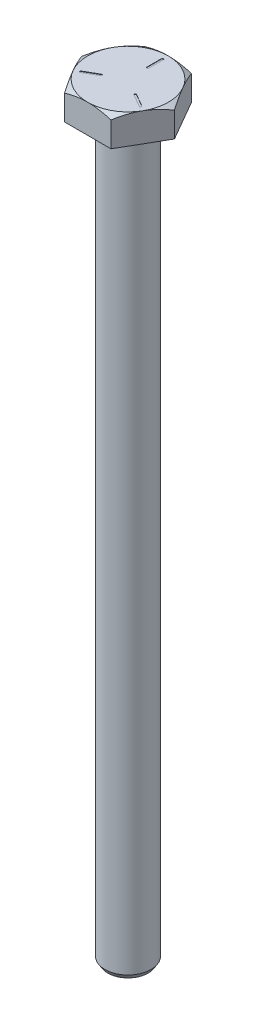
ISO-10303-21;
HEADER;
FILE_DESCRIPTION(('STEP AP214'),'2;1');
FILE_NAME('part.step','',(''),(''),'','','');
FILE_SCHEMA(('AUTOMOTIVE_DESIGN { 1 0 10303 214 1 1 1 1 }'));
ENDSEC;
DATA;
#1=APPLICATION_CONTEXT('core data for automotive mechanical design processes');
#2=APPLICATION_PROTOCOL_DEFINITION('international standard','automotive_design',2000,#1);
#3=PRODUCT_CONTEXT('',#1,'mechanical');
#4=PRODUCT('Part','Part','',(#3));
#5=PRODUCT_RELATED_PRODUCT_CATEGORY('part','',(#4));
#6=PRODUCT_DEFINITION_FORMATION('','',#4);
#7=PRODUCT_DEFINITION_CONTEXT('part definition',#1,'design');
#8=PRODUCT_DEFINITION('design','',#6,#7);
#9=PRODUCT_DEFINITION_SHAPE('','',#8);
#10=(LENGTH_UNIT() NAMED_UNIT(*) SI_UNIT(.MILLI.,.METRE.));
#11=(NAMED_UNIT(*) PLANE_ANGLE_UNIT() SI_UNIT($,.RADIAN.));
#12=(NAMED_UNIT(*) SI_UNIT($,.STERADIAN.) SOLID_ANGLE_UNIT());
#13=UNCERTAINTY_MEASURE_WITH_UNIT(LENGTH_MEASURE(1.E-05),#10,'distance_accuracy_value','');
#14=(GEOMETRIC_REPRESENTATION_CONTEXT(3) GLOBAL_UNCERTAINTY_ASSIGNED_CONTEXT((#13)) GLOBAL_UNIT_ASSIGNED_CONTEXT((#10,
#11,#12)) REPRESENTATION_CONTEXT('',''));
#15=CARTESIAN_POINT('',(0.,0.,0.));
#16=DIRECTION('',(0.,0.,1.));
#17=DIRECTION('',(1.,0.,0.));
#18=AXIS2_PLACEMENT_3D('',#15,#16,#17);
#19=CARTESIAN_POINT('',(0.,3.9624,0.));
#20=DIRECTION('',(0.,1.,0.));
#21=DIRECTION('',(0.,0.,1.));
#22=AXIS2_PLACEMENT_3D('',#19,#20,#21);
#23=PLANE('',#22);
#24=CARTESIAN_POINT('',(0.,3.9624,0.));
#25=DIRECTION('',(0.,1.,0.));
#26=DIRECTION('',(0.,0.,1.));
#27=AXIS2_PLACEMENT_3D('',#24,#25,#26);
#28=CIRCLE('',#27,5.55625);
#29=CARTESIAN_POINT('',(0.,3.9624,5.55625));
#30=VERTEX_POINT('',#29);
#31=CARTESIAN_POINT('',(-4.81185364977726,3.9624,2.77812500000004));
#32=VERTEX_POINT('',#31);
#33=EDGE_CURVE('E11',#30,#32,#28,.F.);
#34=ORIENTED_EDGE('',*,*,#33,.F.);
#35=CARTESIAN_POINT('',(0.,3.9624,0.));
#36=DIRECTION('',(0.,-1.,0.));
#37=DIRECTION('',(1.,0.,0.));
#38=AXIS2_PLACEMENT_3D('',#35,#36,#37);
#39=CIRCLE('',#38,5.55625);
#40=CARTESIAN_POINT('',(4.8118536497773,3.9624,2.77812499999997));
#41=VERTEX_POINT('',#40);
#42=EDGE_CURVE('E199',#41,#30,#39,.T.);
#43=ORIENTED_EDGE('',*,*,#42,.F.);
#44=CARTESIAN_POINT('',(4.81185364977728,3.9624,-2.778125));
#45=VERTEX_POINT('',#44);
#46=EDGE_CURVE('E42',#45,#41,#28,.F.);
#47=ORIENTED_EDGE('',*,*,#46,.F.);
#48=CARTESIAN_POINT('',(0.,3.9624,-5.55625));
#49=VERTEX_POINT('',#48);
#50=EDGE_CURVE('E521',#49,#45,#28,.F.);
#51=ORIENTED_EDGE('',*,*,#50,.F.);
#52=CARTESIAN_POINT('',(-4.8118536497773,3.9624,-2.77812499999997));
#53=VERTEX_POINT('',#52);
#54=EDGE_CURVE('E523',#53,#49,#28,.F.);
#55=ORIENTED_EDGE('',*,*,#54,.F.);
#56=EDGE_CURVE('E41',#32,#53,#28,.F.);
#57=ORIENTED_EDGE('',*,*,#56,.F.);
#58=EDGE_LOOP('',(#34,#43,#47,#51,#55,#57));
#59=FACE_BOUND('',#58,.T.);
#60=DIRECTION('',(0.866025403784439,0.,0.5));
#61=VECTOR('',#60,1.);
#62=CARTESIAN_POINT('',(4.18794598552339,3.9624,2.27126477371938));
#63=LINE('',#62,#61);
#64=CARTESIAN_POINT('',(2.42818236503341,3.9624,1.25526477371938));
#65=VERTEX_POINT('',#64);
#66=CARTESIAN_POINT('',(4.18794598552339,3.9624,2.27126477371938));
#67=VERTEX_POINT('',#66);
#68=EDGE_CURVE('E241',#65,#67,#63,.T.);
#69=ORIENTED_EDGE('',*,*,#68,.T.);
#70=CARTESIAN_POINT('',(4.12444598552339,3.9624,2.38125));
#71=DIRECTION('',(0.,-1.,0.));
#72=DIRECTION('',(0.,0.,-1.));
#73=AXIS2_PLACEMENT_3D('',#70,#71,#72);
#74=CIRCLE('',#73,0.127);
#75=CARTESIAN_POINT('',(4.06094598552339,3.9624,2.49123522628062));
#76=VERTEX_POINT('',#75);
#77=EDGE_CURVE('E248',#67,#76,#74,.T.);
#78=ORIENTED_EDGE('',*,*,#77,.T.);
#79=DIRECTION('',(-0.866025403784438,0.,-0.5));
#80=VECTOR('',#79,1.);
#81=CARTESIAN_POINT('',(4.06094598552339,3.9624,2.49123522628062));
#82=LINE('',#81,#80);
#83=CARTESIAN_POINT('',(2.30118236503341,3.9624,1.47523522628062));
#84=VERTEX_POINT('',#83);
#85=EDGE_CURVE('E251',#76,#84,#82,.T.);
#86=ORIENTED_EDGE('',*,*,#85,.T.);
#87=CARTESIAN_POINT('',(2.36468236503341,3.9624,1.36525));
#88=DIRECTION('',(0.,-1.,0.));
#89=DIRECTION('',(0.,0.,-1.));
#90=AXIS2_PLACEMENT_3D('',#87,#88,#89);
#91=CIRCLE('',#90,0.127);
#92=EDGE_CURVE('E255',#84,#65,#91,.T.);
#93=ORIENTED_EDGE('',*,*,#92,.T.);
#94=EDGE_LOOP('',(#69,#78,#86,#93));
#95=FACE_BOUND('',#94,.T.);
#96=DIRECTION('',(-0.866025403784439,0.,0.5));
#97=VECTOR('',#96,1.);
#98=CARTESIAN_POINT('',(-4.06094598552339,3.9624,2.49123522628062));
#99=LINE('',#98,#97);
#100=CARTESIAN_POINT('',(-2.30118236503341,3.9624,1.47523522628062));
#101=VERTEX_POINT('',#100);
#102=CARTESIAN_POINT('',(-4.06094598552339,3.9624,2.49123522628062));
#103=VERTEX_POINT('',#102);
#104=EDGE_CURVE('E213',#101,#103,#99,.T.);
#105=ORIENTED_EDGE('',*,*,#104,.T.);
#106=CARTESIAN_POINT('',(-4.12444598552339,3.9624,2.38125));
#107=DIRECTION('',(0.,-1.,0.));
#108=DIRECTION('',(0.,0.,-1.));
#109=AXIS2_PLACEMENT_3D('',#106,#107,#108);
#110=CIRCLE('',#109,0.127);
#111=CARTESIAN_POINT('',(-4.18794598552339,3.9624,2.27126477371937));
#112=VERTEX_POINT('',#111);
#113=EDGE_CURVE('E57',#103,#112,#110,.T.);
#114=ORIENTED_EDGE('',*,*,#113,.T.);
#115=DIRECTION('',(0.866025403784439,0.,-0.5));
#116=VECTOR('',#115,1.);
#117=CARTESIAN_POINT('',(-4.18794598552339,3.9624,2.27126477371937));
#118=LINE('',#117,#116);
#119=CARTESIAN_POINT('',(-2.42818236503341,3.9624,1.25526477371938));
#120=VERTEX_POINT('',#119);
#121=EDGE_CURVE('E221',#112,#120,#118,.T.);
#122=ORIENTED_EDGE('',*,*,#121,.T.);
#123=CARTESIAN_POINT('',(-2.36468236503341,3.9624,1.36525));
#124=DIRECTION('',(0.,-1.,0.));
#125=DIRECTION('',(0.,0.,-1.));
#126=AXIS2_PLACEMENT_3D('',#123,#124,#125);
#127=CIRCLE('',#126,0.127);
#128=EDGE_CURVE('E225',#120,#101,#127,.T.);
#129=ORIENTED_EDGE('',*,*,#128,.T.);
#130=EDGE_LOOP('',(#105,#114,#122,#129));
#131=FACE_BOUND('',#130,.T.);
#132=DIRECTION('',(0.,0.,-1.));
#133=VECTOR('',#132,1.);
#134=CARTESIAN_POINT('',(-0.127,3.9624,-4.7625));
#135=LINE('',#134,#133);
#136=CARTESIAN_POINT('',(-0.127,3.9624,-2.7305));
#137=VERTEX_POINT('',#136);
#138=CARTESIAN_POINT('',(-0.127,3.9624,-4.7625));
#139=VERTEX_POINT('',#138);
#140=EDGE_CURVE('E194',#137,#139,#135,.T.);
#141=ORIENTED_EDGE('',*,*,#140,.T.);
#142=CARTESIAN_POINT('',(0.,3.9624,-4.7625));
#143=DIRECTION('',(0.,-1.,0.));
#144=DIRECTION('',(0.,0.,-1.));
#145=AXIS2_PLACEMENT_3D('',#142,#143,#144);
#146=CIRCLE('',#145,0.127);
#147=CARTESIAN_POINT('',(0.127,3.9624,-4.7625));
#148=VERTEX_POINT('',#147);
#149=EDGE_CURVE('E49',#139,#148,#146,.T.);
#150=ORIENTED_EDGE('',*,*,#149,.T.);
#151=DIRECTION('',(0.,0.,1.));
#152=VECTOR('',#151,1.);
#153=CARTESIAN_POINT('',(0.127,3.9624,-4.7625));
#154=LINE('',#153,#152);
#155=CARTESIAN_POINT('',(0.127,3.9624,-2.7305));
#156=VERTEX_POINT('',#155);
#157=EDGE_CURVE('E198',#148,#156,#154,.T.);
#158=ORIENTED_EDGE('',*,*,#157,.T.);
#159=CARTESIAN_POINT('',(0.,3.9624,-2.7305));
#160=DIRECTION('',(0.,-1.,0.));
#161=DIRECTION('',(0.,0.,-1.));
#162=AXIS2_PLACEMENT_3D('',#159,#160,#161);
#163=CIRCLE('',#162,0.127);
#164=EDGE_CURVE('E372',#156,#137,#163,.T.);
#165=ORIENTED_EDGE('',*,*,#164,.T.);
#166=EDGE_LOOP('',(#141,#150,#158,#165));
#167=FACE_BOUND('',#166,.T.);
#168=ADVANCED_FACE('F32',(#59,#95,#131,#167),#23,.T.);
#169=CARTESIAN_POINT('',(3.20790243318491,3.9624,5.55624999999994));
#170=DIRECTION('',(-0.866025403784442,0.,-0.499999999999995));
#171=DIRECTION('',(-0.499999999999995,0.,0.866025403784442));
#172=AXIS2_PLACEMENT_3D('',#169,#170,#171);
#173=PLANE('',#172);
#174=DIRECTION('',(0.,-1.,0.));
#175=VECTOR('',#174,1.);
#176=CARTESIAN_POINT('',(6.41580486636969,3.9624,0.));
#177=LINE('',#176,#175);
#178=CARTESIAN_POINT('',(6.41580486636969,3.4544,0.));
#179=VERTEX_POINT('',#178);
#180=CARTESIAN_POINT('',(6.41580486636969,0.,0.));
#181=VERTEX_POINT('',#180);
#182=EDGE_CURVE('E498',#179,#181,#177,.T.);
#183=ORIENTED_EDGE('',*,*,#182,.F.);
#184=CARTESIAN_POINT('',(6.41592033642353,3.45433175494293,-0.0002));
#185=CARTESIAN_POINT('',(6.34525728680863,3.49608770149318,0.122191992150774));
#186=CARTESIAN_POINT('',(6.2743186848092,3.53595207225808,0.245061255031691));
#187=CARTESIAN_POINT('',(6.13183759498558,3.61136937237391,0.491845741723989));
#188=CARTESIAN_POINT('',(6.06029484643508,3.64692032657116,0.615761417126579));
#189=CARTESIAN_POINT('',(5.84446209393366,3.74640067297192,0.989594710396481));
#190=CARTESIAN_POINT('',(5.69927852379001,3.8029688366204,1.24106003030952));
#191=CARTESIAN_POINT('',(5.48203887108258,3.86918211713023,1.61733014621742));
#192=CARTESIAN_POINT('',(5.41066401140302,3.88801355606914,1.74095502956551));
#193=CARTESIAN_POINT('',(5.26757723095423,3.91954792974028,1.98878860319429));
#194=CARTESIAN_POINT('',(5.19586534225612,3.9322514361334,2.11299723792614));
#195=CARTESIAN_POINT('',(5.05231394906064,3.95119916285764,2.361635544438));
#196=CARTESIAN_POINT('',(4.980474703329,3.9574511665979,2.48606476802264));
#197=CARTESIAN_POINT('',(4.83673361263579,3.96336736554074,2.73503164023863));
#198=CARTESIAN_POINT('',(4.76483176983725,3.9630317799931,2.85956928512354));
#199=CARTESIAN_POINT('',(4.56856862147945,3.9530985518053,3.19950702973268));
#200=CARTESIAN_POINT('',(4.44427753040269,3.93691024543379,3.41478551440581));
#201=CARTESIAN_POINT('',(4.19656247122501,3.88592740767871,3.84384058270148));
#202=CARTESIAN_POINT('',(4.07313946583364,3.85111476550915,4.0576154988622));
#203=CARTESIAN_POINT('',(3.82491070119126,3.76422634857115,4.48756033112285));
#204=CARTESIAN_POINT('',(3.70013908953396,3.71176954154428,4.70367110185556));
#205=CARTESIAN_POINT('',(3.45253692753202,3.5928355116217,5.13253062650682));
#206=CARTESIAN_POINT('',(3.32970290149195,3.52638745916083,5.34528540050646));
#207=CARTESIAN_POINT('',(3.20778696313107,3.45433175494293,5.55644999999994));
#208=B_SPLINE_CURVE_WITH_KNOTS('',3,(#184,#185,#186,#187,#188,#189,#190,#191,#192,#193,#194,
#195,#196,#197,#198,#199,#200,#201,#202,#203,#204,#205,#206,#207),.UNSPECIFIED.,.F.,.F.,(4,2,2,
2,2,2,2,2,2,2,2,4),(0.,0.442059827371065,0.884321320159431,1.77079067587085,2.20264380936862,
2.63445664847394,3.06574791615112,3.49702482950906,4.2435368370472,4.99077609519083,
5.7553162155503,6.51827785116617),.UNSPECIFIED.);
#209=EDGE_CURVE('E495',#179,#41,#208,.T.);
#210=ORIENTED_EDGE('',*,*,#209,.T.);
#211=CARTESIAN_POINT('',(3.20790243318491,3.4544,5.55624999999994));
#212=VERTEX_POINT('',#211);
#213=EDGE_CURVE('E304',#41,#212,#208,.T.);
#214=ORIENTED_EDGE('',*,*,#213,.T.);
#215=DIRECTION('',(0.,-1.,0.));
#216=VECTOR('',#215,1.);
#217=CARTESIAN_POINT('',(3.20790243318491,3.9624,5.55624999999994));
#218=LINE('',#217,#216);
#219=CARTESIAN_POINT('',(3.20790243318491,0.,5.55624999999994));
#220=VERTEX_POINT('',#219);
#221=EDGE_CURVE('E503',#212,#220,#218,.T.);
#222=ORIENTED_EDGE('',*,*,#221,.T.);
#223=DIRECTION('',(0.499999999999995,0.,-0.866025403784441));
#224=VECTOR('',#223,1.);
#225=CARTESIAN_POINT('',(3.20790243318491,0.,5.55624999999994));
#226=LINE('',#225,#224);
#227=EDGE_CURVE('E539',#220,#181,#226,.T.);
#228=ORIENTED_EDGE('',*,*,#227,.T.);
#229=EDGE_LOOP('',(#183,#210,#214,#222,#228));
#230=FACE_BOUND('',#229,.T.);
#231=ADVANCED_FACE('F34',(#230),#173,.F.);
#232=CARTESIAN_POINT('',(6.41580486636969,3.9624,0.));
#233=DIRECTION('',(-0.866025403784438,0.,0.500000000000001));
#234=DIRECTION('',(0.500000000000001,0.,0.866025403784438));
#235=AXIS2_PLACEMENT_3D('',#232,#233,#234);
#236=PLANE('',#235);
#237=DIRECTION('',(0.,-1.,0.));
#238=VECTOR('',#237,1.);
#239=CARTESIAN_POINT('',(3.20790243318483,3.9624,-5.55624999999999));
#240=LINE('',#239,#238);
#241=CARTESIAN_POINT('',(3.20790243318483,3.4544,-5.55624999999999));
#242=VERTEX_POINT('',#241);
#243=CARTESIAN_POINT('',(3.20790243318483,0.,-5.55624999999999));
#244=VERTEX_POINT('',#243);
#245=EDGE_CURVE('E518',#242,#244,#240,.T.);
#246=ORIENTED_EDGE('',*,*,#245,.F.);
#247=CARTESIAN_POINT('',(3.20778696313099,3.45433175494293,-5.55644999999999));
#248=CARTESIAN_POINT('',(3.2784500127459,3.49608770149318,-5.43405800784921));
#249=CARTESIAN_POINT('',(3.34938861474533,3.53595207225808,-5.3111887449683));
#250=CARTESIAN_POINT('',(3.49186970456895,3.61136937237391,-5.064404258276));
#251=CARTESIAN_POINT('',(3.56341245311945,3.64692032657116,-4.94048858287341));
#252=CARTESIAN_POINT('',(3.77924520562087,3.74640067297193,-4.56665528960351));
#253=CARTESIAN_POINT('',(3.92442877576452,3.80296883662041,-4.31518996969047));
#254=CARTESIAN_POINT('',(4.14166842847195,3.86918211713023,-3.93891985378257));
#255=CARTESIAN_POINT('',(4.21304328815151,3.88801355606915,-3.81529497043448));
#256=CARTESIAN_POINT('',(4.35613006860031,3.91954792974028,-3.56746139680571));
#257=CARTESIAN_POINT('',(4.42784195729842,3.93225143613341,-3.44325276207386));
#258=CARTESIAN_POINT('',(4.5713933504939,3.95119916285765,-3.194614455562));
#259=CARTESIAN_POINT('',(4.64323259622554,3.95745116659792,-3.07018523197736));
#260=CARTESIAN_POINT('',(4.78697368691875,3.96336736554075,-2.82121835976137));
#261=CARTESIAN_POINT('',(4.85887552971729,3.96303177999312,-2.69668071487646));
#262=CARTESIAN_POINT('',(5.0551386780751,3.95309855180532,-2.35674297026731));
#263=CARTESIAN_POINT('',(5.17942976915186,3.9369102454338,-2.14146448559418));
#264=CARTESIAN_POINT('',(5.42714482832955,3.88592740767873,-1.7124094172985));
#265=CARTESIAN_POINT('',(5.55056783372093,3.85111476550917,-1.49863450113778));
#266=CARTESIAN_POINT('',(5.79879659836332,3.76422634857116,-1.06868966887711));
#267=CARTESIAN_POINT('',(5.92356821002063,3.71176954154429,-0.852578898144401));
#268=CARTESIAN_POINT('',(6.17117037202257,3.59283551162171,-0.423719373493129));
#269=CARTESIAN_POINT('',(6.29400439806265,3.52638745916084,-0.210964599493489));
#270=CARTESIAN_POINT('',(6.41592033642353,3.45433175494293,0.000200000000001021));
#271=B_SPLINE_CURVE_WITH_KNOTS('',3,(#247,#248,#249,#250,#251,#252,#253,#254,#255,#256,#257,
#258,#259,#260,#261,#262,#263,#264,#265,#266,#267,#268,#269,#270),.UNSPECIFIED.,.F.,.F.,(4,2,2,
2,2,2,2,2,2,2,2,4),(0.,0.442059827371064,0.884321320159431,1.77079067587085,2.20264380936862,
2.63445664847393,3.06574791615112,3.49702482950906,4.24353683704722,4.99077609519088,
5.75531621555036,6.51827785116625),.UNSPECIFIED.);
#272=EDGE_CURVE('E323',#242,#45,#271,.T.);
#273=ORIENTED_EDGE('',*,*,#272,.T.);
#274=EDGE_CURVE('E317',#45,#179,#271,.T.);
#275=ORIENTED_EDGE('',*,*,#274,.T.);
#276=ORIENTED_EDGE('',*,*,#182,.T.);
#277=DIRECTION('',(-0.500000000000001,0.,-0.866025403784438));
#278=VECTOR('',#277,1.);
#279=CARTESIAN_POINT('',(6.41580486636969,0.,0.));
#280=LINE('',#279,#278);
#281=EDGE_CURVE('E540',#181,#244,#280,.T.);
#282=ORIENTED_EDGE('',*,*,#281,.T.);
#283=EDGE_LOOP('',(#246,#273,#275,#276,#282));
#284=FACE_BOUND('',#283,.T.);
#285=ADVANCED_FACE('F331',(#284),#236,.F.);
#286=CARTESIAN_POINT('',(3.20790243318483,3.9624,-5.55624999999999));
#287=DIRECTION('',(0.,0.,1.));
#288=DIRECTION('',(1.,0.,0.));
#289=AXIS2_PLACEMENT_3D('',#286,#287,#288);
#290=PLANE('',#289);
#291=DIRECTION('',(0.,-1.,0.));
#292=VECTOR('',#291,1.);
#293=CARTESIAN_POINT('',(-3.20790243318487,3.9624,-5.55624999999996));
#294=LINE('',#293,#292);
#295=CARTESIAN_POINT('',(-3.20790243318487,3.4544,-5.55624999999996));
#296=VERTEX_POINT('',#295);
#297=CARTESIAN_POINT('',(-3.20790243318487,0.,-5.55624999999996));
#298=VERTEX_POINT('',#297);
#299=EDGE_CURVE('E516',#296,#298,#294,.T.);
#300=ORIENTED_EDGE('',*,*,#299,.F.);
#301=CARTESIAN_POINT('',(-9.64398746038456,0.668253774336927,-5.55624999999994));
#302=CARTESIAN_POINT('',(-9.41845867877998,0.783728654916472,-5.55624999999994));
#303=CARTESIAN_POINT('',(-9.19253036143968,0.898430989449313,-5.55624999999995));
#304=CARTESIAN_POINT('',(-8.73969781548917,1.12592725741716,-5.55624999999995));
#305=CARTESIAN_POINT('',(-8.51279352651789,1.23872107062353,-5.55624999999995));
#306=CARTESIAN_POINT('',(-8.05743404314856,1.46223170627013,-5.55624999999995));
#307=CARTESIAN_POINT('',(-7.82897673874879,1.57294423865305,-5.55624999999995));
#308=CARTESIAN_POINT('',(-7.37073056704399,1.79157256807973,-5.55624999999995));
#309=CARTESIAN_POINT('',(-7.14094172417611,1.89948841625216,-5.55624999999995));
#310=CARTESIAN_POINT('',(-6.6692381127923,2.11674940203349,-5.55624999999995));
#311=CARTESIAN_POINT('',(-6.42724930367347,2.22593428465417,-5.55624999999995));
#312=CARTESIAN_POINT('',(-5.94121021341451,2.43961089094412,-5.55624999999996));
#313=CARTESIAN_POINT('',(-5.69715999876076,2.5441027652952,-5.55624999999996));
#314=CARTESIAN_POINT('',(-5.20672896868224,2.7471044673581,-5.55624999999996));
#315=CARTESIAN_POINT('',(-4.96034952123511,2.84561758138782,-5.55624999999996));
#316=CARTESIAN_POINT('',(-4.46471370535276,3.03508638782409,-5.55624999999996));
#317=CARTESIAN_POINT('',(-4.21545762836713,3.12604283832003,-5.55624999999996));
#318=CARTESIAN_POINT('',(-3.65491811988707,3.31847041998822,-5.55624999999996));
#319=CARTESIAN_POINT('',(-3.34275939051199,3.41742695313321,-5.55624999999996));
#320=CARTESIAN_POINT('',(-2.71269101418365,3.59558398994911,-5.55624999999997));
#321=CARTESIAN_POINT('',(-2.39478151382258,3.67478499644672,-5.55624999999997));
#322=CARTESIAN_POINT('',(-1.91666726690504,3.77360947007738,-5.55624999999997));
#323=CARTESIAN_POINT('',(-1.75847647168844,3.80304839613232,-5.55624999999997));
#324=CARTESIAN_POINT('',(-1.44096533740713,3.85496489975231,-5.55624999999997));
#325=CARTESIAN_POINT('',(-1.2816451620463,3.87744346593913,-5.55624999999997));
#326=CARTESIAN_POINT('',(-0.962160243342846,3.91481307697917,-5.55624999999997));
#327=CARTESIAN_POINT('',(-0.801995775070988,3.92970645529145,-5.55624999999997));
#328=CARTESIAN_POINT('',(-0.481117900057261,3.95145821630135,-5.55624999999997));
#329=CARTESIAN_POINT('',(-0.320404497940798,3.9583166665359,-5.55624999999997));
#330=CARTESIAN_POINT('',(0.00254855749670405,3.96379729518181,-5.55624999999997));
#331=CARTESIAN_POINT('',(0.164789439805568,3.96234806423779,-5.55624999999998));
#332=CARTESIAN_POINT('',(0.488978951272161,3.95109605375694,-5.55624999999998));
#333=CARTESIAN_POINT('',(0.650927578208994,3.9412932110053,-5.55624999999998));
#334=CARTESIAN_POINT('',(0.974174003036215,3.91365045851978,-5.55624999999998));
#335=CARTESIAN_POINT('',(1.1354716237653,3.89580849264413,-5.55624999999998));
#336=CARTESIAN_POINT('',(1.45706960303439,3.85262859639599,-5.55624999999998));
#337=CARTESIAN_POINT('',(1.61736980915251,3.82728954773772,-5.55624999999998));
#338=CARTESIAN_POINT('',(2.10204742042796,3.74002376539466,-5.55624999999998));
#339=CARTESIAN_POINT('',(2.42451495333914,3.66737375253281,-5.55624999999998));
#340=CARTESIAN_POINT('',(3.06356333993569,3.50016427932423,-5.55624999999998));
#341=CARTESIAN_POINT('',(3.38014339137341,3.40560185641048,-5.55624999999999));
#342=CARTESIAN_POINT('',(3.95798444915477,3.21651884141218,-5.55624999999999));
#343=CARTESIAN_POINT('',(4.22003782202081,3.12438216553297,-5.55624999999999));
#344=CARTESIAN_POINT('',(4.74084627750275,2.93117288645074,-5.55624999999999));
#345=CARTESIAN_POINT('',(4.99960089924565,2.83009904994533,-5.55624999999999));
#346=CARTESIAN_POINT('',(5.51448209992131,2.62096288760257,-5.55624999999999));
#347=CARTESIAN_POINT('',(5.77060652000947,2.51289528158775,-5.55624999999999));
#348=CARTESIAN_POINT('',(6.28048347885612,2.29136310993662,-5.55625));
#349=CARTESIAN_POINT('',(6.53423614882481,2.17789884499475,-5.55625));
#350=CARTESIAN_POINT('',(7.02823725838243,1.95198859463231,-5.55625));
#351=CARTESIAN_POINT('',(7.26857302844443,1.83973290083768,-5.55625));
#352=CARTESIAN_POINT('',(7.74775886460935,1.61208629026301,-5.55625));
#353=CARTESIAN_POINT('',(7.98660889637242,1.49669530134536,-5.55625));
#354=CARTESIAN_POINT('',(8.4624876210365,1.26364627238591,-5.55625));
#355=CARTESIAN_POINT('',(8.69951930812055,1.14599433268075,-5.55625));
#356=CARTESIAN_POINT('',(9.17250797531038,0.90859257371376,-5.55625));
#357=CARTESIAN_POINT('',(9.40846503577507,0.788842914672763,-5.55625000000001));
#358=CARTESIAN_POINT('',(9.64398746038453,0.668253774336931,-5.55625000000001));
#359=B_SPLINE_CURVE_WITH_KNOTS('',3,(#301,#302,#303,#304,#305,#306,#307,#308,#309,#310,#311,
#312,#313,#314,#315,#316,#317,#318,#319,#320,#321,#322,#323,#324,#325,#326,#327,#328,#329,#330,
#331,#332,#333,#334,#335,#336,#337,#338,#339,#340,#341,#342,#343,#344,#345,#346,#347,#348,#349,
#350,#351,#352,#353,#354,#355,#356,#357,#358),.UNSPECIFIED.,.F.,.F.,(4,2,2,2,2,2,2,2,2,2,2,2,2,
2,2,2,2,2,2,2,2,2,2,2,2,2,2,2,4),(0.,0.760121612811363,1.52029093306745,2.28188531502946,
3.04346576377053,3.8398678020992,4.63624425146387,5.43217891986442,6.22803364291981,
7.2099847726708,8.19191090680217,8.67450244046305,9.15702539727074,9.63939982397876,
10.1217701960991,10.6082930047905,11.0948194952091,11.5814704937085,12.0681941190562,
13.0587120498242,14.0493639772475,14.8825044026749,15.7157599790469,16.5496521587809,
17.3834979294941,18.1792496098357,18.9750196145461,19.7688812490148,20.5626825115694),.UNSPECIFIED.);
#360=EDGE_CURVE('E536',#296,#49,#359,.T.);
#361=ORIENTED_EDGE('',*,*,#360,.T.);
#362=EDGE_CURVE('E324',#49,#242,#359,.T.);
#363=ORIENTED_EDGE('',*,*,#362,.T.);
#364=ORIENTED_EDGE('',*,*,#245,.T.);
#365=DIRECTION('',(-1.,0.,0.));
#366=VECTOR('',#365,1.);
#367=CARTESIAN_POINT('',(3.20790243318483,0.,-5.55624999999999));
#368=LINE('',#367,#366);
#369=EDGE_CURVE('E541',#244,#298,#368,.T.);
#370=ORIENTED_EDGE('',*,*,#369,.T.);
#371=EDGE_LOOP('',(#300,#361,#363,#364,#370));
#372=FACE_BOUND('',#371,.T.);
#373=ADVANCED_FACE('F334',(#372),#290,.F.);
#374=CARTESIAN_POINT('',(-3.20790243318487,3.9624,-5.55624999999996));
#375=DIRECTION('',(0.866025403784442,0.,0.499999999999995));
#376=DIRECTION('',(0.499999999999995,0.,-0.866025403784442));
#377=AXIS2_PLACEMENT_3D('',#374,#375,#376);
#378=PLANE('',#377);
#379=DIRECTION('',(0.,-1.,0.));
#380=VECTOR('',#379,1.);
#381=CARTESIAN_POINT('',(-6.41580486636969,3.9624,0.));
#382=LINE('',#381,#380);
#383=CARTESIAN_POINT('',(-6.41580486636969,3.4544,0.));
#384=VERTEX_POINT('',#383);
#385=CARTESIAN_POINT('',(-6.41580486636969,0.,0.));
#386=VERTEX_POINT('',#385);
#387=EDGE_CURVE('E509',#384,#386,#382,.T.);
#388=ORIENTED_EDGE('',*,*,#387,.F.);
#389=CARTESIAN_POINT('',(-6.41592033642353,3.45433175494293,0.000200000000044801));
#390=CARTESIAN_POINT('',(-6.34525728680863,3.49608770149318,-0.122191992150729));
#391=CARTESIAN_POINT('',(-6.2743186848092,3.53595207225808,-0.245061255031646));
#392=CARTESIAN_POINT('',(-6.13183759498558,3.61136937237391,-0.491845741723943));
#393=CARTESIAN_POINT('',(-6.06029484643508,3.64692032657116,-0.615761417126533));
#394=CARTESIAN_POINT('',(-5.84446209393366,3.74640067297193,-0.989594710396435));
#395=CARTESIAN_POINT('',(-5.69927852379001,3.80296883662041,-1.24106003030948));
#396=CARTESIAN_POINT('',(-5.48203887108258,3.86918211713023,-1.61733014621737));
#397=CARTESIAN_POINT('',(-5.41066401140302,3.88801355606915,-1.74095502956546));
#398=CARTESIAN_POINT('',(-5.26757723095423,3.91954792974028,-1.98878860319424));
#399=CARTESIAN_POINT('',(-5.19586534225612,3.93225143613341,-2.11299723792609));
#400=CARTESIAN_POINT('',(-5.05231394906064,3.95119916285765,-2.36163554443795));
#401=CARTESIAN_POINT('',(-4.980474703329,3.95745116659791,-2.48606476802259));
#402=CARTESIAN_POINT('',(-4.83673361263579,3.96336736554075,-2.73503164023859));
#403=CARTESIAN_POINT('',(-4.76483176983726,3.96303177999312,-2.85956928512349));
#404=CARTESIAN_POINT('',(-4.56856862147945,3.95309855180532,-3.19950702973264));
#405=CARTESIAN_POINT('',(-4.44427753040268,3.9369102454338,-3.41478551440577));
#406=CARTESIAN_POINT('',(-4.196562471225,3.88592740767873,-3.84384058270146));
#407=CARTESIAN_POINT('',(-4.07313946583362,3.85111476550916,-4.05761549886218));
#408=CARTESIAN_POINT('',(-3.82491070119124,3.76422634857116,-4.48756033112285));
#409=CARTESIAN_POINT('',(-3.70013908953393,3.71176954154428,-4.70367110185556));
#410=CARTESIAN_POINT('',(-3.45253692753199,3.59283551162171,-5.13253062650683));
#411=CARTESIAN_POINT('',(-3.32970290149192,3.52638745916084,-5.34528540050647));
#412=CARTESIAN_POINT('',(-3.20778696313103,3.45433175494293,-5.55644999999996));
#413=B_SPLINE_CURVE_WITH_KNOTS('',3,(#389,#390,#391,#392,#393,#394,#395,#396,#397,#398,#399,
#400,#401,#402,#403,#404,#405,#406,#407,#408,#409,#410,#411,#412),.UNSPECIFIED.,.F.,.F.,(4,2,2,
2,2,2,2,2,2,2,2,4),(0.,0.442059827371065,0.88432132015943,1.77079067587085,2.20264380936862,
2.63445664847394,3.06574791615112,3.49702482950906,4.24353683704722,4.99077609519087,
5.75531621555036,6.51827785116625),.UNSPECIFIED.);
#414=EDGE_CURVE('E310',#384,#53,#413,.T.);
#415=ORIENTED_EDGE('',*,*,#414,.T.);
#416=EDGE_CURVE('E532',#53,#296,#413,.T.);
#417=ORIENTED_EDGE('',*,*,#416,.T.);
#418=ORIENTED_EDGE('',*,*,#299,.T.);
#419=DIRECTION('',(-0.499999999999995,0.,0.866025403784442));
#420=VECTOR('',#419,1.);
#421=CARTESIAN_POINT('',(-3.20790243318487,0.,-5.55624999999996));
#422=LINE('',#421,#420);
#423=EDGE_CURVE('E545',#298,#386,#422,.T.);
#424=ORIENTED_EDGE('',*,*,#423,.T.);
#425=EDGE_LOOP('',(#388,#415,#417,#418,#424));
#426=FACE_BOUND('',#425,.T.);
#427=ADVANCED_FACE('F338',(#426),#378,.F.);
#428=CARTESIAN_POINT('',(-6.41580486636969,3.9624,0.));
#429=DIRECTION('',(0.866025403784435,0.,-0.500000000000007));
#430=DIRECTION('',(-0.500000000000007,0.,-0.866025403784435));
#431=AXIS2_PLACEMENT_3D('',#428,#429,#430);
#432=PLANE('',#431);
#433=DIRECTION('',(0.,-1.,0.));
#434=VECTOR('',#433,1.);
#435=CARTESIAN_POINT('',(-3.20790243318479,3.9624,5.55625000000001));
#436=LINE('',#435,#434);
#437=CARTESIAN_POINT('',(-3.20790243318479,3.4544,5.55625000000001));
#438=VERTEX_POINT('',#437);
#439=CARTESIAN_POINT('',(-3.20790243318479,0.,5.55625000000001));
#440=VERTEX_POINT('',#439);
#441=EDGE_CURVE('E507',#438,#440,#436,.T.);
#442=ORIENTED_EDGE('',*,*,#441,.F.);
#443=CARTESIAN_POINT('',(-3.20778696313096,3.45433175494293,5.55645000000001));
#444=CARTESIAN_POINT('',(-3.27845001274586,3.49608770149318,5.43405800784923));
#445=CARTESIAN_POINT('',(-3.34938861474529,3.53595207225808,5.31118874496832));
#446=CARTESIAN_POINT('',(-3.49186970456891,3.61136937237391,5.06440425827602));
#447=CARTESIAN_POINT('',(-3.56341245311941,3.64692032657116,4.94048858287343));
#448=CARTESIAN_POINT('',(-3.77924520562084,3.74640067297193,4.56665528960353));
#449=CARTESIAN_POINT('',(-3.92442877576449,3.80296883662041,4.3151899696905));
#450=CARTESIAN_POINT('',(-4.14166842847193,3.86918211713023,3.9389198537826));
#451=CARTESIAN_POINT('',(-4.21304328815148,3.88801355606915,3.81529497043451));
#452=CARTESIAN_POINT('',(-4.35613006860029,3.91954792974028,3.56746139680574));
#453=CARTESIAN_POINT('',(-4.4278419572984,3.93225143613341,3.44325276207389));
#454=CARTESIAN_POINT('',(-4.57139335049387,3.95119916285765,3.19461445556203));
#455=CARTESIAN_POINT('',(-4.64323259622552,3.95745116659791,3.07018523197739));
#456=CARTESIAN_POINT('',(-4.78697368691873,3.96336736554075,2.8212183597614));
#457=CARTESIAN_POINT('',(-4.85887552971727,3.96303177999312,2.6966807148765));
#458=CARTESIAN_POINT('',(-5.05513867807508,3.95309855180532,2.35674297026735));
#459=CARTESIAN_POINT('',(-5.17942976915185,3.9369102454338,2.14146448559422));
#460=CARTESIAN_POINT('',(-5.42714482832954,3.88592740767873,1.71240941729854));
#461=CARTESIAN_POINT('',(-5.55056783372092,3.85111476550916,1.49863450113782));
#462=CARTESIAN_POINT('',(-5.79879659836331,3.76422634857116,1.06868966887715));
#463=CARTESIAN_POINT('',(-5.92356821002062,3.71176954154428,0.852578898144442));
#464=CARTESIAN_POINT('',(-6.17117037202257,3.5928355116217,0.423719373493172));
#465=CARTESIAN_POINT('',(-6.29400439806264,3.52638745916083,0.210964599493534));
#466=CARTESIAN_POINT('',(-6.41592033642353,3.45433175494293,-0.000199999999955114));
#467=B_SPLINE_CURVE_WITH_KNOTS('',3,(#443,#444,#445,#446,#447,#448,#449,#450,#451,#452,#453,
#454,#455,#456,#457,#458,#459,#460,#461,#462,#463,#464,#465,#466),.UNSPECIFIED.,.F.,.F.,(4,2,2,
2,2,2,2,2,2,2,2,4),(0.,0.442059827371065,0.88432132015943,1.77079067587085,2.20264380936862,
2.63445664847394,3.06574791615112,3.49702482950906,4.24353683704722,4.99077609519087,
5.75531621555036,6.51827785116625),.UNSPECIFIED.);
#468=EDGE_CURVE('E277',#438,#32,#467,.T.);
#469=ORIENTED_EDGE('',*,*,#468,.T.);
#470=EDGE_CURVE('E499',#32,#384,#467,.T.);
#471=ORIENTED_EDGE('',*,*,#470,.T.);
#472=ORIENTED_EDGE('',*,*,#387,.T.);
#473=DIRECTION('',(0.500000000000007,0.,0.866025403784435));
#474=VECTOR('',#473,1.);
#475=CARTESIAN_POINT('',(-6.41580486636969,0.,0.));
#476=LINE('',#475,#474);
#477=EDGE_CURVE('E511',#386,#440,#476,.T.);
#478=ORIENTED_EDGE('',*,*,#477,.T.);
#479=EDGE_LOOP('',(#442,#469,#471,#472,#478));
#480=FACE_BOUND('',#479,.T.);
#481=ADVANCED_FACE('F342',(#480),#432,.F.);
#482=CARTESIAN_POINT('',(-3.20790243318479,3.9624,5.55625000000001));
#483=DIRECTION('',(0.,0.,-1.));
#484=DIRECTION('',(-1.,0.,0.));
#485=AXIS2_PLACEMENT_3D('',#482,#483,#484);
#486=PLANE('',#485);
#487=ORIENTED_EDGE('',*,*,#221,.F.);
#488=CARTESIAN_POINT('',(9.6439874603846,0.668253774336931,5.55624999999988));
#489=CARTESIAN_POINT('',(9.41845867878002,0.783728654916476,5.55624999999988));
#490=CARTESIAN_POINT('',(9.19253036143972,0.898430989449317,5.55624999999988));
#491=CARTESIAN_POINT('',(8.7396978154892,1.12592725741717,5.55624999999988));
#492=CARTESIAN_POINT('',(8.51279352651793,1.23872107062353,5.55624999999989));
#493=CARTESIAN_POINT('',(8.0574340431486,1.46223170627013,5.55624999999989));
#494=CARTESIAN_POINT('',(7.82897673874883,1.57294423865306,5.55624999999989));
#495=CARTESIAN_POINT('',(7.37073056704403,1.79157256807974,5.5562499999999));
#496=CARTESIAN_POINT('',(7.14094172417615,1.89948841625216,5.5562499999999));
#497=CARTESIAN_POINT('',(6.66923811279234,2.11674940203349,5.55624999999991));
#498=CARTESIAN_POINT('',(6.42724930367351,2.22593428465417,5.55624999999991));
#499=CARTESIAN_POINT('',(5.94121021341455,2.43961089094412,5.55624999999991));
#500=CARTESIAN_POINT('',(5.6971599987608,2.54410276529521,5.55624999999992));
#501=CARTESIAN_POINT('',(5.20672896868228,2.7471044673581,5.55624999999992));
#502=CARTESIAN_POINT('',(4.96034952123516,2.84561758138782,5.55624999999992));
#503=CARTESIAN_POINT('',(4.4647137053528,3.03508638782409,5.55624999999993));
#504=CARTESIAN_POINT('',(4.21545762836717,3.12604283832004,5.55624999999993));
#505=CARTESIAN_POINT('',(3.65491811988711,3.31847041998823,5.55624999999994));
#506=CARTESIAN_POINT('',(3.34275939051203,3.41742695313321,5.55624999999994));
#507=CARTESIAN_POINT('',(2.71269101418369,3.59558398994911,5.55624999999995));
#508=CARTESIAN_POINT('',(2.39478151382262,3.67478499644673,5.55624999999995));
#509=CARTESIAN_POINT('',(1.91666726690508,3.77360947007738,5.55624999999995));
#510=CARTESIAN_POINT('',(1.75847647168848,3.80304839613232,5.55624999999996));
#511=CARTESIAN_POINT('',(1.44096533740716,3.85496489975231,5.55624999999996));
#512=CARTESIAN_POINT('',(1.28164516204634,3.87744346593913,5.55624999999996));
#513=CARTESIAN_POINT('',(0.962160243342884,3.91481307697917,5.55624999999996));
#514=CARTESIAN_POINT('',(0.801995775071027,3.92970645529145,5.55624999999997));
#515=CARTESIAN_POINT('',(0.481117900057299,3.95145821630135,5.55624999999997));
#516=CARTESIAN_POINT('',(0.320404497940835,3.9583166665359,5.55624999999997));
#517=CARTESIAN_POINT('',(-0.00254855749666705,3.96379729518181,5.55624999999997));
#518=CARTESIAN_POINT('',(-0.164789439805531,3.96234806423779,5.55624999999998));
#519=CARTESIAN_POINT('',(-0.488978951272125,3.95109605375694,5.55624999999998));
#520=CARTESIAN_POINT('',(-0.650927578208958,3.9412932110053,5.55624999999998));
#521=CARTESIAN_POINT('',(-0.974174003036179,3.91365045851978,5.55624999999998));
#522=CARTESIAN_POINT('',(-1.13547162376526,3.89580849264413,5.55624999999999));
#523=CARTESIAN_POINT('',(-1.45706960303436,3.85262859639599,5.55624999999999));
#524=CARTESIAN_POINT('',(-1.61736980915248,3.82728954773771,5.55624999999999));
#525=CARTESIAN_POINT('',(-2.10204742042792,3.74002376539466,5.55625));
#526=CARTESIAN_POINT('',(-2.4245149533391,3.66737375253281,5.55625));
#527=CARTESIAN_POINT('',(-3.06356333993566,3.50016427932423,5.55625000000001));
#528=CARTESIAN_POINT('',(-3.38014339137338,3.40560185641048,5.55625000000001));
#529=CARTESIAN_POINT('',(-3.95798444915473,3.21651884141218,5.55625000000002));
#530=CARTESIAN_POINT('',(-4.22003782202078,3.12438216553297,5.55625000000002));
#531=CARTESIAN_POINT('',(-4.74084627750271,2.93117288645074,5.55625000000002));
#532=CARTESIAN_POINT('',(-4.99960089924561,2.83009904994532,5.55625000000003));
#533=CARTESIAN_POINT('',(-5.51448209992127,2.62096288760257,5.55625000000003));
#534=CARTESIAN_POINT('',(-5.77060652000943,2.51289528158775,5.55625000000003));
#535=CARTESIAN_POINT('',(-6.28048347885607,2.29136310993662,5.55625000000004));
#536=CARTESIAN_POINT('',(-6.53423614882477,2.17789884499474,5.55625000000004));
#537=CARTESIAN_POINT('',(-7.02823725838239,1.95198859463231,5.55625000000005));
#538=CARTESIAN_POINT('',(-7.26857302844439,1.83973290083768,5.55625000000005));
#539=CARTESIAN_POINT('',(-7.74775886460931,1.61208629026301,5.55625000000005));
#540=CARTESIAN_POINT('',(-7.98660889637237,1.49669530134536,5.55625000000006));
#541=CARTESIAN_POINT('',(-8.46248762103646,1.26364627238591,5.55625000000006));
#542=CARTESIAN_POINT('',(-8.69951930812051,1.14599433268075,5.55625000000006));
#543=CARTESIAN_POINT('',(-9.17250797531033,0.908592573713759,5.55625000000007));
#544=CARTESIAN_POINT('',(-9.40846503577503,0.788842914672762,5.55625000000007));
#545=CARTESIAN_POINT('',(-9.64398746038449,0.668253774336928,5.55625000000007));
#546=B_SPLINE_CURVE_WITH_KNOTS('',3,(#488,#489,#490,#491,#492,#493,#494,#495,#496,#497,#498,
#499,#500,#501,#502,#503,#504,#505,#506,#507,#508,#509,#510,#511,#512,#513,#514,#515,#516,#517,
#518,#519,#520,#521,#522,#523,#524,#525,#526,#527,#528,#529,#530,#531,#532,#533,#534,#535,#536,
#537,#538,#539,#540,#541,#542,#543,#544,#545),.UNSPECIFIED.,.F.,.F.,(4,2,2,2,2,2,2,2,2,2,2,2,2,
2,2,2,2,2,2,2,2,2,2,2,2,2,2,2,4),(0.,0.760121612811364,1.52029093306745,2.28188531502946,
3.04346576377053,3.8398678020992,4.63624425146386,5.43217891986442,6.2280336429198,
7.2099847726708,8.19191090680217,8.67450244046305,9.15702539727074,9.63939982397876,
10.1217701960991,10.6082930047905,11.0948194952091,11.5814704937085,12.0681941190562,
13.0587120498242,14.0493639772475,14.8825044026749,15.7157599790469,16.5496521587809,
17.3834979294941,18.1792496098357,18.9750196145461,19.7688812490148,20.5626825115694),.UNSPECIFIED.);
#547=EDGE_CURVE('E276',#212,#30,#546,.T.);
#548=ORIENTED_EDGE('',*,*,#547,.T.);
#549=EDGE_CURVE('E203',#30,#438,#546,.T.);
#550=ORIENTED_EDGE('',*,*,#549,.T.);
#551=ORIENTED_EDGE('',*,*,#441,.T.);
#552=DIRECTION('',(1.,0.,0.));
#553=VECTOR('',#552,1.);
#554=CARTESIAN_POINT('',(-3.20790243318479,0.,5.55625000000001));
#555=LINE('',#554,#553);
#556=EDGE_CURVE('E505',#440,#220,#555,.T.);
#557=ORIENTED_EDGE('',*,*,#556,.T.);
#558=EDGE_LOOP('',(#487,#548,#550,#551,#557));
#559=FACE_BOUND('',#558,.T.);
#560=ADVANCED_FACE('F284',(#559),#486,.F.);
#561=CARTESIAN_POINT('',(0.,0.,0.));
#562=DIRECTION('',(0.,1.,0.));
#563=DIRECTION('',(0.,0.,1.));
#564=AXIS2_PLACEMENT_3D('',#561,#562,#563);
#565=PLANE('',#564);
#566=CARTESIAN_POINT('',(0.,0.,0.));
#567=DIRECTION('',(0.,1.,0.));
#568=DIRECTION('',(-1.,0.,0.));
#569=AXIS2_PLACEMENT_3D('',#566,#567,#568);
#570=CIRCLE('',#569,3.175);
#571=CARTESIAN_POINT('',(-3.175,0.,0.));
#572=VERTEX_POINT('',#571);
#573=EDGE_CURVE('E392',#572,#572,#570,.T.);
#574=ORIENTED_EDGE('',*,*,#573,.T.);
#575=EDGE_LOOP('',(#574));
#576=FACE_BOUND('',#575,.T.);
#577=ORIENTED_EDGE('',*,*,#227,.F.);
#578=ORIENTED_EDGE('',*,*,#556,.F.);
#579=ORIENTED_EDGE('',*,*,#477,.F.);
#580=ORIENTED_EDGE('',*,*,#423,.F.);
#581=ORIENTED_EDGE('',*,*,#369,.F.);
#582=ORIENTED_EDGE('',*,*,#281,.F.);
#583=EDGE_LOOP('',(#577,#578,#579,#580,#581,#582));
#584=FACE_BOUND('',#583,.T.);
#585=ADVANCED_FACE('F350',(#576,#584),#565,.F.);
#586=CARTESIAN_POINT('',(0.,3.9624,0.));
#587=DIRECTION('',(0.,-1.,0.));
#588=DIRECTION('',(1.,0.,0.));
#589=AXIS2_PLACEMENT_3D('',#586,#587,#588);
#590=CONICAL_SURFACE('',#589,5.55625,1.03701810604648);
#591=ORIENTED_EDGE('',*,*,#42,.T.);
#592=ORIENTED_EDGE('',*,*,#547,.F.);
#593=ORIENTED_EDGE('',*,*,#213,.F.);
#594=EDGE_LOOP('',(#591,#592,#593));
#595=FACE_BOUND('',#594,.T.);
#596=ADVANCED_FACE('F475',(#595),#590,.T.);
#597=ORIENTED_EDGE('',*,*,#46,.T.);
#598=ORIENTED_EDGE('',*,*,#209,.F.);
#599=ORIENTED_EDGE('',*,*,#274,.F.);
#600=EDGE_LOOP('',(#597,#598,#599));
#601=FACE_BOUND('',#600,.T.);
#602=ADVANCED_FACE('F480',(#601),#590,.T.);
#603=ORIENTED_EDGE('',*,*,#50,.T.);
#604=ORIENTED_EDGE('',*,*,#272,.F.);
#605=ORIENTED_EDGE('',*,*,#362,.F.);
#606=EDGE_LOOP('',(#603,#604,#605));
#607=FACE_BOUND('',#606,.T.);
#608=ADVANCED_FACE('F293',(#607),#590,.T.);
#609=ORIENTED_EDGE('',*,*,#416,.F.);
#610=ORIENTED_EDGE('',*,*,#54,.T.);
#611=ORIENTED_EDGE('',*,*,#360,.F.);
#612=EDGE_LOOP('',(#609,#610,#611));
#613=FACE_BOUND('',#612,.T.);
#614=ADVANCED_FACE('F287',(#613),#590,.T.);
#615=ORIENTED_EDGE('',*,*,#470,.F.);
#616=ORIENTED_EDGE('',*,*,#56,.T.);
#617=ORIENTED_EDGE('',*,*,#414,.F.);
#618=EDGE_LOOP('',(#615,#616,#617));
#619=FACE_BOUND('',#618,.T.);
#620=ADVANCED_FACE('F292',(#619),#590,.T.);
#621=ORIENTED_EDGE('',*,*,#549,.F.);
#622=ORIENTED_EDGE('',*,*,#33,.T.);
#623=ORIENTED_EDGE('',*,*,#468,.F.);
#624=EDGE_LOOP('',(#621,#622,#623));
#625=FACE_BOUND('',#624,.T.);
#626=ADVANCED_FACE('F295',(#625),#590,.T.);
#627=CARTESIAN_POINT('',(4.12444598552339,3.9116,2.38125));
#628=DIRECTION('',(0.,1.,0.));
#629=DIRECTION('',(0.,0.,1.));
#630=AXIS2_PLACEMENT_3D('',#627,#628,#629);
#631=CYLINDRICAL_SURFACE('',#630,0.127);
#632=ORIENTED_EDGE('',*,*,#77,.F.);
#633=DIRECTION('',(0.,1.,0.));
#634=VECTOR('',#633,1.);
#635=CARTESIAN_POINT('',(4.18794598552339,3.9116,2.27126477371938));
#636=LINE('',#635,#634);
#637=CARTESIAN_POINT('',(4.18794598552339,3.9116,2.27126477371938));
#638=VERTEX_POINT('',#637);
#639=EDGE_CURVE('E247',#638,#67,#636,.T.);
#640=ORIENTED_EDGE('',*,*,#639,.F.);
#641=CARTESIAN_POINT('',(4.12444598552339,3.9116,2.38125));
#642=DIRECTION('',(0.,-1.,0.));
#643=DIRECTION('',(0.,0.,-1.));
#644=AXIS2_PLACEMENT_3D('',#641,#642,#643);
#645=CIRCLE('',#644,0.127);
#646=CARTESIAN_POINT('',(4.06094598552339,3.9116,2.49123522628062));
#647=VERTEX_POINT('',#646);
#648=EDGE_CURVE('E237',#638,#647,#645,.T.);
#649=ORIENTED_EDGE('',*,*,#648,.T.);
#650=DIRECTION('',(0.,1.,0.));
#651=VECTOR('',#650,1.);
#652=CARTESIAN_POINT('',(4.06094598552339,3.9116,2.49123522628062));
#653=LINE('',#652,#651);
#654=EDGE_CURVE('E222',#647,#76,#653,.T.);
#655=ORIENTED_EDGE('',*,*,#654,.T.);
#656=EDGE_LOOP('',(#632,#640,#649,#655));
#657=FACE_BOUND('',#656,.T.);
#658=ADVANCED_FACE('F296',(#657),#631,.F.);
#659=CARTESIAN_POINT('',(4.06094598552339,3.9116,2.49123522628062));
#660=DIRECTION('',(0.5,0.,-0.866025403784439));
#661=DIRECTION('',(-0.866025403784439,0.,-0.5));
#662=AXIS2_PLACEMENT_3D('',#659,#660,#661);
#663=PLANE('',#662);
#664=ORIENTED_EDGE('',*,*,#85,.F.);
#665=ORIENTED_EDGE('',*,*,#654,.F.);
#666=DIRECTION('',(-0.866025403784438,0.,-0.5));
#667=VECTOR('',#666,1.);
#668=CARTESIAN_POINT('',(4.06094598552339,3.9116,2.49123522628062));
#669=LINE('',#668,#667);
#670=CARTESIAN_POINT('',(2.30118236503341,3.9116,1.47523522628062));
#671=VERTEX_POINT('',#670);
#672=EDGE_CURVE('E240',#647,#671,#669,.T.);
#673=ORIENTED_EDGE('',*,*,#672,.T.);
#674=DIRECTION('',(0.,1.,0.));
#675=VECTOR('',#674,1.);
#676=CARTESIAN_POINT('',(2.30118236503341,3.9116,1.47523522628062));
#677=LINE('',#676,#675);
#678=EDGE_CURVE('E264',#671,#84,#677,.T.);
#679=ORIENTED_EDGE('',*,*,#678,.T.);
#680=EDGE_LOOP('',(#664,#665,#673,#679));
#681=FACE_BOUND('',#680,.T.);
#682=ADVANCED_FACE('F455',(#681),#663,.T.);
#683=CARTESIAN_POINT('',(2.36468236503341,3.9116,1.36525));
#684=DIRECTION('',(0.,1.,0.));
#685=DIRECTION('',(0.,0.,1.));
#686=AXIS2_PLACEMENT_3D('',#683,#684,#685);
#687=CYLINDRICAL_SURFACE('',#686,0.127);
#688=ORIENTED_EDGE('',*,*,#92,.F.);
#689=ORIENTED_EDGE('',*,*,#678,.F.);
#690=CARTESIAN_POINT('',(2.36468236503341,3.9116,1.36525));
#691=DIRECTION('',(0.,-1.,0.));
#692=DIRECTION('',(0.,0.,-1.));
#693=AXIS2_PLACEMENT_3D('',#690,#691,#692);
#694=CIRCLE('',#693,0.127);
#695=CARTESIAN_POINT('',(2.42818236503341,3.9116,1.25526477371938));
#696=VERTEX_POINT('',#695);
#697=EDGE_CURVE('E243',#671,#696,#694,.T.);
#698=ORIENTED_EDGE('',*,*,#697,.T.);
#699=DIRECTION('',(0.,1.,0.));
#700=VECTOR('',#699,1.);
#701=CARTESIAN_POINT('',(2.42818236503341,3.9116,1.25526477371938));
#702=LINE('',#701,#700);
#703=EDGE_CURVE('E262',#696,#65,#702,.T.);
#704=ORIENTED_EDGE('',*,*,#703,.T.);
#705=EDGE_LOOP('',(#688,#689,#698,#704));
#706=FACE_BOUND('',#705,.T.);
#707=ADVANCED_FACE('F452',(#706),#687,.F.);
#708=CARTESIAN_POINT('',(4.18794598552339,3.9116,2.27126477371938));
#709=DIRECTION('',(-0.5,0.,0.866025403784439));
#710=DIRECTION('',(0.866025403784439,0.,0.5));
#711=AXIS2_PLACEMENT_3D('',#708,#709,#710);
#712=PLANE('',#711);
#713=ORIENTED_EDGE('',*,*,#68,.F.);
#714=ORIENTED_EDGE('',*,*,#703,.F.);
#715=DIRECTION('',(0.866025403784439,0.,0.5));
#716=VECTOR('',#715,1.);
#717=CARTESIAN_POINT('',(4.18794598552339,3.9116,2.27126477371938));
#718=LINE('',#717,#716);
#719=EDGE_CURVE('E245',#696,#638,#718,.T.);
#720=ORIENTED_EDGE('',*,*,#719,.T.);
#721=ORIENTED_EDGE('',*,*,#639,.T.);
#722=EDGE_LOOP('',(#713,#714,#720,#721));
#723=FACE_BOUND('',#722,.T.);
#724=ADVANCED_FACE('F448',(#723),#712,.T.);
#725=CARTESIAN_POINT('',(4.12444598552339,3.9116,2.38125));
#726=DIRECTION('',(0.,-1.,0.));
#727=DIRECTION('',(0.,0.,-1.));
#728=AXIS2_PLACEMENT_3D('',#725,#726,#727);
#729=PLANE('',#728);
#730=ORIENTED_EDGE('',*,*,#648,.F.);
#731=ORIENTED_EDGE('',*,*,#719,.F.);
#732=ORIENTED_EDGE('',*,*,#697,.F.);
#733=ORIENTED_EDGE('',*,*,#672,.F.);
#734=EDGE_LOOP('',(#730,#731,#732,#733));
#735=FACE_BOUND('',#734,.T.);
#736=ADVANCED_FACE('F445',(#735),#729,.F.);
#737=CARTESIAN_POINT('',(-4.12444598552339,3.9116,2.38125));
#738=DIRECTION('',(0.,1.,0.));
#739=DIRECTION('',(0.,0.,1.));
#740=AXIS2_PLACEMENT_3D('',#737,#738,#739);
#741=CYLINDRICAL_SURFACE('',#740,0.127);
#742=ORIENTED_EDGE('',*,*,#113,.F.);
#743=DIRECTION('',(0.,1.,0.));
#744=VECTOR('',#743,1.);
#745=CARTESIAN_POINT('',(-4.06094598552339,3.9116,2.49123522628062));
#746=LINE('',#745,#744);
#747=CARTESIAN_POINT('',(-4.06094598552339,3.9116,2.49123522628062));
#748=VERTEX_POINT('',#747);
#749=EDGE_CURVE('E219',#748,#103,#746,.T.);
#750=ORIENTED_EDGE('',*,*,#749,.F.);
#751=CARTESIAN_POINT('',(-4.12444598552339,3.9116,2.38125));
#752=DIRECTION('',(0.,-1.,0.));
#753=DIRECTION('',(0.,0.,-1.));
#754=AXIS2_PLACEMENT_3D('',#751,#752,#753);
#755=CIRCLE('',#754,0.127);
#756=CARTESIAN_POINT('',(-4.18794598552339,3.9116,2.27126477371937));
#757=VERTEX_POINT('',#756);
#758=EDGE_CURVE('E209',#748,#757,#755,.T.);
#759=ORIENTED_EDGE('',*,*,#758,.T.);
#760=DIRECTION('',(0.,1.,0.));
#761=VECTOR('',#760,1.);
#762=CARTESIAN_POINT('',(-4.18794598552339,3.9116,2.27126477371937));
#763=LINE('',#762,#761);
#764=EDGE_CURVE('E235',#757,#112,#763,.T.);
#765=ORIENTED_EDGE('',*,*,#764,.T.);
#766=EDGE_LOOP('',(#742,#750,#759,#765));
#767=FACE_BOUND('',#766,.T.);
#768=ADVANCED_FACE('F441',(#767),#741,.F.);
#769=CARTESIAN_POINT('',(-4.18794598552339,3.9116,2.27126477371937));
#770=DIRECTION('',(0.5,0.,0.866025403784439));
#771=DIRECTION('',(0.866025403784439,0.,-0.5));
#772=AXIS2_PLACEMENT_3D('',#769,#770,#771);
#773=PLANE('',#772);
#774=ORIENTED_EDGE('',*,*,#121,.F.);
#775=ORIENTED_EDGE('',*,*,#764,.F.);
#776=DIRECTION('',(0.866025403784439,0.,-0.5));
#777=VECTOR('',#776,1.);
#778=CARTESIAN_POINT('',(-4.18794598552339,3.9116,2.27126477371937));
#779=LINE('',#778,#777);
#780=CARTESIAN_POINT('',(-2.42818236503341,3.9116,1.25526477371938));
#781=VERTEX_POINT('',#780);
#782=EDGE_CURVE('E212',#757,#781,#779,.T.);
#783=ORIENTED_EDGE('',*,*,#782,.T.);
#784=DIRECTION('',(0.,1.,0.));
#785=VECTOR('',#784,1.);
#786=CARTESIAN_POINT('',(-2.42818236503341,3.9116,1.25526477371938));
#787=LINE('',#786,#785);
#788=EDGE_CURVE('E233',#781,#120,#787,.T.);
#789=ORIENTED_EDGE('',*,*,#788,.T.);
#790=EDGE_LOOP('',(#774,#775,#783,#789));
#791=FACE_BOUND('',#790,.T.);
#792=ADVANCED_FACE('F437',(#791),#773,.T.);
#793=CARTESIAN_POINT('',(-2.36468236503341,3.9116,1.36525));
#794=DIRECTION('',(0.,1.,0.));
#795=DIRECTION('',(0.,0.,1.));
#796=AXIS2_PLACEMENT_3D('',#793,#794,#795);
#797=CYLINDRICAL_SURFACE('',#796,0.127);
#798=ORIENTED_EDGE('',*,*,#128,.F.);
#799=ORIENTED_EDGE('',*,*,#788,.F.);
#800=CARTESIAN_POINT('',(-2.36468236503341,3.9116,1.36525));
#801=DIRECTION('',(0.,-1.,0.));
#802=DIRECTION('',(0.,0.,-1.));
#803=AXIS2_PLACEMENT_3D('',#800,#801,#802);
#804=CIRCLE('',#803,0.127);
#805=CARTESIAN_POINT('',(-2.30118236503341,3.9116,1.47523522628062));
#806=VERTEX_POINT('',#805);
#807=EDGE_CURVE('E215',#781,#806,#804,.T.);
#808=ORIENTED_EDGE('',*,*,#807,.T.);
#809=DIRECTION('',(0.,1.,0.));
#810=VECTOR('',#809,1.);
#811=CARTESIAN_POINT('',(-2.30118236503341,3.9116,1.47523522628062));
#812=LINE('',#811,#810);
#813=EDGE_CURVE('E231',#806,#101,#812,.T.);
#814=ORIENTED_EDGE('',*,*,#813,.T.);
#815=EDGE_LOOP('',(#798,#799,#808,#814));
#816=FACE_BOUND('',#815,.T.);
#817=ADVANCED_FACE('F433',(#816),#797,.F.);
#818=CARTESIAN_POINT('',(-4.06094598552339,3.9116,2.49123522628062));
#819=DIRECTION('',(-0.5,0.,-0.866025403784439));
#820=DIRECTION('',(-0.866025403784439,0.,0.5));
#821=AXIS2_PLACEMENT_3D('',#818,#819,#820);
#822=PLANE('',#821);
#823=ORIENTED_EDGE('',*,*,#104,.F.);
#824=ORIENTED_EDGE('',*,*,#813,.F.);
#825=DIRECTION('',(-0.866025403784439,0.,0.5));
#826=VECTOR('',#825,1.);
#827=CARTESIAN_POINT('',(-4.06094598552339,3.9116,2.49123522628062));
#828=LINE('',#827,#826);
#829=EDGE_CURVE('E217',#806,#748,#828,.T.);
#830=ORIENTED_EDGE('',*,*,#829,.T.);
#831=ORIENTED_EDGE('',*,*,#749,.T.);
#832=EDGE_LOOP('',(#823,#824,#830,#831));
#833=FACE_BOUND('',#832,.T.);
#834=ADVANCED_FACE('F429',(#833),#822,.T.);
#835=CARTESIAN_POINT('',(-4.12444598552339,3.9116,2.38125));
#836=DIRECTION('',(0.,-1.,0.));
#837=DIRECTION('',(0.,0.,-1.));
#838=AXIS2_PLACEMENT_3D('',#835,#836,#837);
#839=PLANE('',#838);
#840=ORIENTED_EDGE('',*,*,#758,.F.);
#841=ORIENTED_EDGE('',*,*,#829,.F.);
#842=ORIENTED_EDGE('',*,*,#807,.F.);
#843=ORIENTED_EDGE('',*,*,#782,.F.);
#844=EDGE_LOOP('',(#840,#841,#842,#843));
#845=FACE_BOUND('',#844,.T.);
#846=ADVANCED_FACE('F426',(#845),#839,.F.);
#847=CARTESIAN_POINT('',(0.,3.9116,-4.7625));
#848=DIRECTION('',(0.,1.,0.));
#849=DIRECTION('',(0.,0.,1.));
#850=AXIS2_PLACEMENT_3D('',#847,#848,#849);
#851=CYLINDRICAL_SURFACE('',#850,0.127);
#852=ORIENTED_EDGE('',*,*,#149,.F.);
#853=DIRECTION('',(0.,1.,0.));
#854=VECTOR('',#853,1.);
#855=CARTESIAN_POINT('',(-0.127,3.9116,-4.7625));
#856=LINE('',#855,#854);
#857=CARTESIAN_POINT('',(-0.127,3.9116,-4.7625));
#858=VERTEX_POINT('',#857);
#859=EDGE_CURVE('E193',#858,#139,#856,.T.);
#860=ORIENTED_EDGE('',*,*,#859,.F.);
#861=CARTESIAN_POINT('',(0.,3.9116,-4.7625));
#862=DIRECTION('',(0.,-1.,0.));
#863=DIRECTION('',(0.,0.,-1.));
#864=AXIS2_PLACEMENT_3D('',#861,#862,#863);
#865=CIRCLE('',#864,0.127);
#866=CARTESIAN_POINT('',(0.127,3.9116,-4.7625));
#867=VERTEX_POINT('',#866);
#868=EDGE_CURVE('E185',#858,#867,#865,.T.);
#869=ORIENTED_EDGE('',*,*,#868,.T.);
#870=DIRECTION('',(0.,1.,0.));
#871=VECTOR('',#870,1.);
#872=CARTESIAN_POINT('',(0.127,3.9116,-4.7625));
#873=LINE('',#872,#871);
#874=EDGE_CURVE('E192',#867,#148,#873,.T.);
#875=ORIENTED_EDGE('',*,*,#874,.T.);
#876=EDGE_LOOP('',(#852,#860,#869,#875));
#877=FACE_BOUND('',#876,.T.);
#878=ADVANCED_FACE('F191',(#877),#851,.F.);
#879=CARTESIAN_POINT('',(0.127,3.9116,-4.7625));
#880=DIRECTION('',(-1.,0.,0.));
#881=DIRECTION('',(0.,0.,1.));
#882=AXIS2_PLACEMENT_3D('',#879,#880,#881);
#883=PLANE('',#882);
#884=ORIENTED_EDGE('',*,*,#157,.F.);
#885=ORIENTED_EDGE('',*,*,#874,.F.);
#886=DIRECTION('',(0.,0.,1.));
#887=VECTOR('',#886,1.);
#888=CARTESIAN_POINT('',(0.127,3.9116,-4.7625));
#889=LINE('',#888,#887);
#890=CARTESIAN_POINT('',(0.127,3.9116,-2.7305));
#891=VERTEX_POINT('',#890);
#892=EDGE_CURVE('E181',#867,#891,#889,.T.);
#893=ORIENTED_EDGE('',*,*,#892,.T.);
#894=DIRECTION('',(0.,1.,0.));
#895=VECTOR('',#894,1.);
#896=CARTESIAN_POINT('',(0.127,3.9116,-2.7305));
#897=LINE('',#896,#895);
#898=EDGE_CURVE('E200',#891,#156,#897,.T.);
#899=ORIENTED_EDGE('',*,*,#898,.T.);
#900=EDGE_LOOP('',(#884,#885,#893,#899));
#901=FACE_BOUND('',#900,.T.);
#902=ADVANCED_FACE('F196',(#901),#883,.T.);
#903=CARTESIAN_POINT('',(0.,3.9116,-2.7305));
#904=DIRECTION('',(0.,1.,0.));
#905=DIRECTION('',(0.,0.,1.));
#906=AXIS2_PLACEMENT_3D('',#903,#904,#905);
#907=CYLINDRICAL_SURFACE('',#906,0.127);
#908=ORIENTED_EDGE('',*,*,#164,.F.);
#909=ORIENTED_EDGE('',*,*,#898,.F.);
#910=CARTESIAN_POINT('',(0.,3.9116,-2.7305));
#911=DIRECTION('',(0.,-1.,0.));
#912=DIRECTION('',(0.,0.,-1.));
#913=AXIS2_PLACEMENT_3D('',#910,#911,#912);
#914=CIRCLE('',#913,0.127);
#915=CARTESIAN_POINT('',(-0.127,3.9116,-2.7305));
#916=VERTEX_POINT('',#915);
#917=EDGE_CURVE('E186',#891,#916,#914,.T.);
#918=ORIENTED_EDGE('',*,*,#917,.T.);
#919=DIRECTION('',(0.,1.,0.));
#920=VECTOR('',#919,1.);
#921=CARTESIAN_POINT('',(-0.127,3.9116,-2.7305));
#922=LINE('',#921,#920);
#923=EDGE_CURVE('E205',#916,#137,#922,.T.);
#924=ORIENTED_EDGE('',*,*,#923,.T.);
#925=EDGE_LOOP('',(#908,#909,#918,#924));
#926=FACE_BOUND('',#925,.T.);
#927=ADVANCED_FACE('F381',(#926),#907,.F.);
#928=CARTESIAN_POINT('',(-0.127,3.9116,-4.7625));
#929=DIRECTION('',(1.,0.,0.));
#930=DIRECTION('',(0.,0.,-1.));
#931=AXIS2_PLACEMENT_3D('',#928,#929,#930);
#932=PLANE('',#931);
#933=ORIENTED_EDGE('',*,*,#140,.F.);
#934=ORIENTED_EDGE('',*,*,#923,.F.);
#935=DIRECTION('',(0.,0.,-1.));
#936=VECTOR('',#935,1.);
#937=CARTESIAN_POINT('',(-0.127,3.9116,-4.7625));
#938=LINE('',#937,#936);
#939=EDGE_CURVE('E379',#916,#858,#938,.T.);
#940=ORIENTED_EDGE('',*,*,#939,.T.);
#941=ORIENTED_EDGE('',*,*,#859,.T.);
#942=EDGE_LOOP('',(#933,#934,#940,#941));
#943=FACE_BOUND('',#942,.T.);
#944=ADVANCED_FACE('F382',(#943),#932,.T.);
#945=CARTESIAN_POINT('',(0.,3.9116,-4.7625));
#946=DIRECTION('',(0.,-1.,0.));
#947=DIRECTION('',(0.,0.,-1.));
#948=AXIS2_PLACEMENT_3D('',#945,#946,#947);
#949=PLANE('',#948);
#950=ORIENTED_EDGE('',*,*,#868,.F.);
#951=ORIENTED_EDGE('',*,*,#939,.F.);
#952=ORIENTED_EDGE('',*,*,#917,.F.);
#953=ORIENTED_EDGE('',*,*,#892,.F.);
#954=EDGE_LOOP('',(#950,#951,#952,#953));
#955=FACE_BOUND('',#954,.T.);
#956=ADVANCED_FACE('F183',(#955),#949,.F.);
#957=CARTESIAN_POINT('',(0.,-101.6,0.));
#958=DIRECTION('',(0.,1.,0.));
#959=DIRECTION('',(-1.,0.,0.));
#960=AXIS2_PLACEMENT_3D('',#957,#958,#959);
#961=PLANE('',#960);
#962=CARTESIAN_POINT('',(0.,-101.6,0.));
#963=DIRECTION('',(0.,1.,0.));
#964=DIRECTION('',(-1.,0.,0.));
#965=AXIS2_PLACEMENT_3D('',#962,#963,#964);
#966=CIRCLE('',#965,2.778125);
#967=CARTESIAN_POINT('',(-2.77812499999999,-101.6,0.));
#968=VERTEX_POINT('',#967);
#969=EDGE_CURVE('E252',#968,#968,#966,.T.);
#970=ORIENTED_EDGE('',*,*,#969,.F.);
#971=EDGE_LOOP('',(#970));
#972=FACE_BOUND('',#971,.T.);
#973=ADVANCED_FACE('F407',(#972),#961,.F.);
#974=CARTESIAN_POINT('',(0.,-101.6,0.));
#975=DIRECTION('',(0.,1.,0.));
#976=DIRECTION('',(-1.,0.,0.));
#977=AXIS2_PLACEMENT_3D('',#974,#975,#976);
#978=CONICAL_SURFACE('',#977,2.778125,0.558599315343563);
#979=CARTESIAN_POINT('',(0.,-100.965,0.));
#980=DIRECTION('',(0.,1.,0.));
#981=DIRECTION('',(-1.,0.,0.));
#982=AXIS2_PLACEMENT_3D('',#979,#980,#981);
#983=CIRCLE('',#982,3.175);
#984=CARTESIAN_POINT('',(-3.17499999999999,-100.965,0.));
#985=VERTEX_POINT('',#984);
#986=EDGE_CURVE('E389',#985,#985,#983,.T.);
#987=ORIENTED_EDGE('',*,*,#986,.F.);
#988=EDGE_LOOP('',(#987));
#989=FACE_BOUND('',#988,.T.);
#990=ORIENTED_EDGE('',*,*,#969,.T.);
#991=EDGE_LOOP('',(#990));
#992=FACE_BOUND('',#991,.T.);
#993=ADVANCED_FACE('F401',(#989,#992),#978,.T.);
#994=CARTESIAN_POINT('',(0.,0.,0.));
#995=DIRECTION('',(0.,1.,0.));
#996=DIRECTION('',(-1.,0.,0.));
#997=AXIS2_PLACEMENT_3D('',#994,#995,#996);
#998=CYLINDRICAL_SURFACE('',#997,3.175);
#999=ORIENTED_EDGE('',*,*,#573,.F.);
#1000=EDGE_LOOP('',(#999));
#1001=FACE_BOUND('',#1000,.T.);
#1002=ORIENTED_EDGE('',*,*,#986,.T.);
#1003=EDGE_LOOP('',(#1002));
#1004=FACE_BOUND('',#1003,.T.);
#1005=ADVANCED_FACE('F398',(#1001,#1004),#998,.T.);
#1006=CLOSED_SHELL('',(#168,#231,#285,#373,#427,#481,#560,#585,#596,#602,#608,#614,#620,#626,
#658,#682,#707,#724,#736,#768,#792,#817,#834,#846,#878,#902,#927,#944,#956,#973,#993,#1005));
#1007=MANIFOLD_SOLID_BREP('B2',#1006);
#1008=ADVANCED_BREP_SHAPE_REPRESENTATION('',(#18,#1007),#14);
#1009=SHAPE_DEFINITION_REPRESENTATION(#9,#1008);
ENDSEC;
END-ISO-10303-21;
